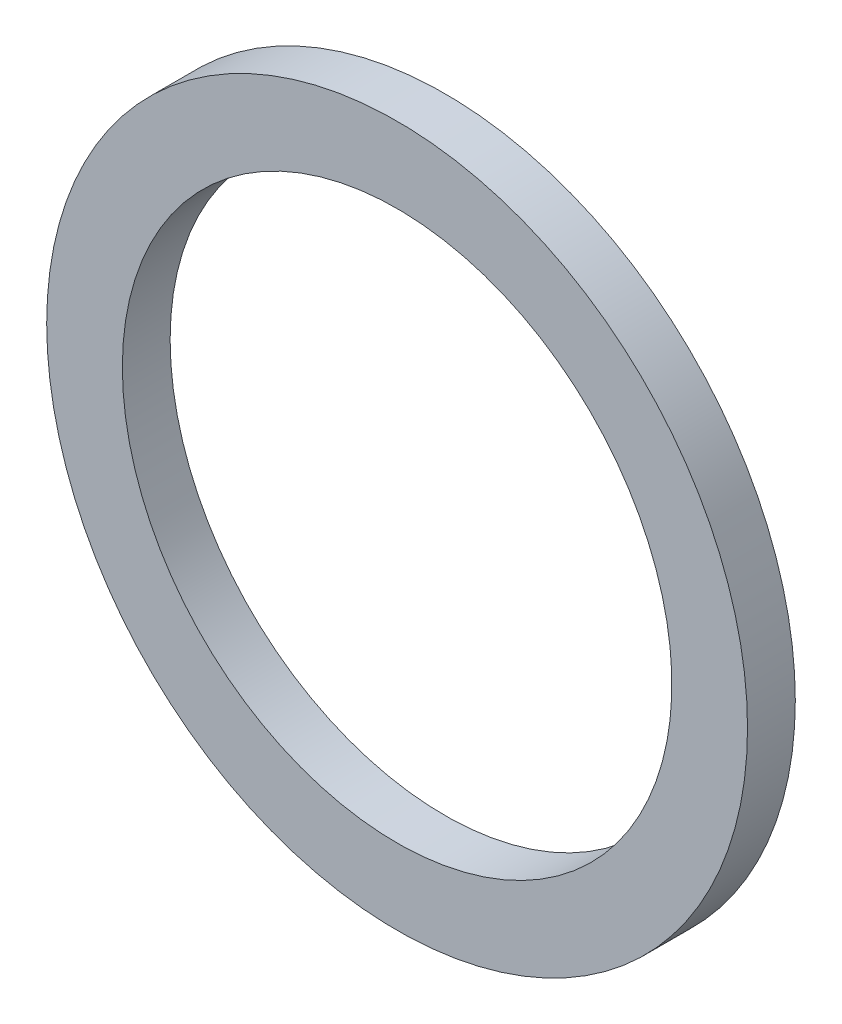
ISO-10303-21;
HEADER;
FILE_DESCRIPTION(('STEP AP214'),'2;1');
FILE_NAME('part.step','',(''),(''),'','','');
FILE_SCHEMA(('AUTOMOTIVE_DESIGN { 1 0 10303 214 1 1 1 1 }'));
ENDSEC;
DATA;
#1=APPLICATION_CONTEXT('core data for automotive mechanical design processes');
#2=APPLICATION_PROTOCOL_DEFINITION('international standard','automotive_design',2000,#1);
#3=PRODUCT_CONTEXT('',#1,'mechanical');
#4=PRODUCT('Part','Part','',(#3));
#5=PRODUCT_RELATED_PRODUCT_CATEGORY('part','',(#4));
#6=PRODUCT_DEFINITION_FORMATION('','',#4);
#7=PRODUCT_DEFINITION_CONTEXT('part definition',#1,'design');
#8=PRODUCT_DEFINITION('design','',#6,#7);
#9=PRODUCT_DEFINITION_SHAPE('','',#8);
#10=(LENGTH_UNIT() NAMED_UNIT(*) SI_UNIT(.MILLI.,.METRE.));
#11=(NAMED_UNIT(*) PLANE_ANGLE_UNIT() SI_UNIT($,.RADIAN.));
#12=(NAMED_UNIT(*) SI_UNIT($,.STERADIAN.) SOLID_ANGLE_UNIT());
#13=UNCERTAINTY_MEASURE_WITH_UNIT(LENGTH_MEASURE(1.E-05),#10,'distance_accuracy_value','');
#14=(GEOMETRIC_REPRESENTATION_CONTEXT(3) GLOBAL_UNCERTAINTY_ASSIGNED_CONTEXT((#13)) GLOBAL_UNIT_ASSIGNED_CONTEXT((#10,
#11,#12)) REPRESENTATION_CONTEXT('',''));
#15=CARTESIAN_POINT('',(0.,0.,0.));
#16=DIRECTION('',(0.,0.,1.));
#17=DIRECTION('',(1.,0.,0.));
#18=AXIS2_PLACEMENT_3D('',#15,#16,#17);
#19=CARTESIAN_POINT('',(0.,0.,1.5));
#20=DIRECTION('',(0.,0.,0.999999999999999));
#21=DIRECTION('',(0.999999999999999,0.,0.));
#22=AXIS2_PLACEMENT_3D('',#19,#20,#21);
#23=PLANE('',#22);
#24=CARTESIAN_POINT('',(0.,0.,1.5));
#25=DIRECTION('',(0.,0.,0.999999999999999));
#26=DIRECTION('',(0.999999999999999,0.,0.));
#27=AXIS2_PLACEMENT_3D('',#24,#25,#26);
#28=CIRCLE('',#27,11.);
#29=CARTESIAN_POINT('',(-11.,0.,1.5));
#30=VERTEX_POINT('',#29);
#31=EDGE_CURVE('E10',#30,#30,#28,.T.);
#32=ORIENTED_EDGE('',*,*,#31,.T.);
#33=EDGE_LOOP('',(#32));
#34=FACE_BOUND('',#33,.T.);
#35=CARTESIAN_POINT('',(0.,0.,1.5));
#36=DIRECTION('',(0.,0.,0.999999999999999));
#37=DIRECTION('',(0.999999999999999,0.,0.));
#38=AXIS2_PLACEMENT_3D('',#35,#36,#37);
#39=CIRCLE('',#38,8.625);
#40=CARTESIAN_POINT('',(-8.62499999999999,0.,1.5));
#41=VERTEX_POINT('',#40);
#42=EDGE_CURVE('E43',#41,#41,#39,.T.);
#43=ORIENTED_EDGE('',*,*,#42,.F.);
#44=EDGE_LOOP('',(#43));
#45=FACE_BOUND('',#44,.T.);
#46=ADVANCED_FACE('F32',(#34,#45),#23,.T.);
#47=CARTESIAN_POINT('',(0.,0.,0.));
#48=DIRECTION('',(0.,0.,0.999999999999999));
#49=DIRECTION('',(0.999999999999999,0.,0.));
#50=AXIS2_PLACEMENT_3D('',#47,#48,#49);
#51=PLANE('',#50);
#52=CARTESIAN_POINT('',(0.,0.,0.));
#53=DIRECTION('',(0.,0.,0.999999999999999));
#54=DIRECTION('',(0.999999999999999,0.,0.));
#55=AXIS2_PLACEMENT_3D('',#52,#53,#54);
#56=CIRCLE('',#55,11.);
#57=CARTESIAN_POINT('',(-11.,0.,0.));
#58=VERTEX_POINT('',#57);
#59=EDGE_CURVE('E39',#58,#58,#56,.T.);
#60=ORIENTED_EDGE('',*,*,#59,.F.);
#61=EDGE_LOOP('',(#60));
#62=FACE_BOUND('',#61,.T.);
#63=CARTESIAN_POINT('',(0.,0.,0.));
#64=DIRECTION('',(0.,0.,0.999999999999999));
#65=DIRECTION('',(0.999999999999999,0.,0.));
#66=AXIS2_PLACEMENT_3D('',#63,#64,#65);
#67=CIRCLE('',#66,8.625);
#68=CARTESIAN_POINT('',(-8.62499999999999,0.,0.));
#69=VERTEX_POINT('',#68);
#70=EDGE_CURVE('E47',#69,#69,#67,.T.);
#71=ORIENTED_EDGE('',*,*,#70,.T.);
#72=EDGE_LOOP('',(#71));
#73=FACE_BOUND('',#72,.T.);
#74=ADVANCED_FACE('F53',(#62,#73),#51,.F.);
#75=CARTESIAN_POINT('',(0.,0.,1.5));
#76=DIRECTION('',(0.,0.,-0.999999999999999));
#77=DIRECTION('',(-0.999999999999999,0.,0.));
#78=AXIS2_PLACEMENT_3D('',#75,#76,#77);
#79=CYLINDRICAL_SURFACE('',#78,11.);
#80=CARTESIAN_POINT('',(-11.,0.,1.5));
#81=CARTESIAN_POINT('',(-11.,0.,1.484375));
#82=CARTESIAN_POINT('',(-11.,0.,1.46875));
#83=CARTESIAN_POINT('',(-11.,0.,1.4375));
#84=CARTESIAN_POINT('',(-11.,0.,1.421875));
#85=CARTESIAN_POINT('',(-11.,0.,1.390625));
#86=CARTESIAN_POINT('',(-11.,0.,1.375));
#87=CARTESIAN_POINT('',(-11.,0.,1.34375));
#88=CARTESIAN_POINT('',(-11.,0.,1.328125));
#89=CARTESIAN_POINT('',(-11.,0.,1.296875));
#90=CARTESIAN_POINT('',(-11.,0.,1.28125));
#91=CARTESIAN_POINT('',(-11.,0.,1.25));
#92=CARTESIAN_POINT('',(-11.,0.,1.234375));
#93=CARTESIAN_POINT('',(-11.,0.,1.203125));
#94=CARTESIAN_POINT('',(-11.,0.,1.1875));
#95=CARTESIAN_POINT('',(-11.,0.,1.15625));
#96=CARTESIAN_POINT('',(-11.,0.,1.140625));
#97=CARTESIAN_POINT('',(-11.,0.,1.109375));
#98=CARTESIAN_POINT('',(-11.,0.,1.09375));
#99=CARTESIAN_POINT('',(-11.,0.,1.0625));
#100=CARTESIAN_POINT('',(-11.,0.,1.046875));
#101=CARTESIAN_POINT('',(-11.,0.,1.015625));
#102=CARTESIAN_POINT('',(-11.,0.,1.));
#103=CARTESIAN_POINT('',(-11.,0.,0.968750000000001));
#104=CARTESIAN_POINT('',(-11.,0.,0.953125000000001));
#105=CARTESIAN_POINT('',(-11.,0.,0.921875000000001));
#106=CARTESIAN_POINT('',(-11.,0.,0.906250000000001));
#107=CARTESIAN_POINT('',(-11.,0.,0.875000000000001));
#108=CARTESIAN_POINT('',(-11.,0.,0.859375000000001));
#109=CARTESIAN_POINT('',(-11.,0.,0.828125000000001));
#110=CARTESIAN_POINT('',(-11.,0.,0.812500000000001));
#111=CARTESIAN_POINT('',(-11.,0.,0.781250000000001));
#112=CARTESIAN_POINT('',(-11.,0.,0.765625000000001));
#113=CARTESIAN_POINT('',(-11.,0.,0.734375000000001));
#114=CARTESIAN_POINT('',(-11.,0.,0.718750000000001));
#115=CARTESIAN_POINT('',(-11.,0.,0.687500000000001));
#116=CARTESIAN_POINT('',(-11.,0.,0.671875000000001));
#117=CARTESIAN_POINT('',(-11.,0.,0.640625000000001));
#118=CARTESIAN_POINT('',(-11.,0.,0.625000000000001));
#119=CARTESIAN_POINT('',(-11.,0.,0.593750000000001));
#120=CARTESIAN_POINT('',(-11.,0.,0.578125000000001));
#121=CARTESIAN_POINT('',(-11.,0.,0.546875));
#122=CARTESIAN_POINT('',(-11.,0.,0.53125));
#123=CARTESIAN_POINT('',(-11.,0.,0.5));
#124=CARTESIAN_POINT('',(-11.,0.,0.484375));
#125=CARTESIAN_POINT('',(-11.,0.,0.453125));
#126=CARTESIAN_POINT('',(-11.,0.,0.4375));
#127=CARTESIAN_POINT('',(-11.,0.,0.40625));
#128=CARTESIAN_POINT('',(-11.,0.,0.390625));
#129=CARTESIAN_POINT('',(-11.,0.,0.359375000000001));
#130=CARTESIAN_POINT('',(-11.,0.,0.34375));
#131=CARTESIAN_POINT('',(-11.,0.,0.3125));
#132=CARTESIAN_POINT('',(-11.,0.,0.296875));
#133=CARTESIAN_POINT('',(-11.,0.,0.265625));
#134=CARTESIAN_POINT('',(-11.,0.,0.25));
#135=CARTESIAN_POINT('',(-11.,0.,0.21875));
#136=CARTESIAN_POINT('',(-11.,0.,0.203125));
#137=CARTESIAN_POINT('',(-11.,0.,0.171875));
#138=CARTESIAN_POINT('',(-11.,0.,0.15625));
#139=CARTESIAN_POINT('',(-11.,0.,0.125));
#140=CARTESIAN_POINT('',(-11.,0.,0.109375));
#141=CARTESIAN_POINT('',(-11.,0.,0.0781250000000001));
#142=CARTESIAN_POINT('',(-11.,0.,0.0625000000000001));
#143=CARTESIAN_POINT('',(-11.,0.,0.03125));
#144=CARTESIAN_POINT('',(-11.,0.,0.015625));
#145=CARTESIAN_POINT('',(-11.,0.,0.));
#146=B_SPLINE_CURVE_WITH_KNOTS('',3,(#80,#81,#82,#83,#84,#85,#86,#87,#88,#89,#90,#91,#92,#93,
#94,#95,#96,#97,#98,#99,#100,#101,#102,#103,#104,#105,#106,#107,#108,#109,#110,#111,#112,#113,
#114,#115,#116,#117,#118,#119,#120,#121,#122,#123,#124,#125,#126,#127,#128,#129,#130,#131,#132,
#133,#134,#135,#136,#137,#138,#139,#140,#141,#142,#143,#144,#145),.UNSPECIFIED.,.F.,.F.,(4,2,2,
2,2,2,2,2,2,2,2,2,2,2,2,2,2,2,2,2,2,2,2,2,2,2,2,2,2,2,2,2,4),(0.,0.0468750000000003,
0.0937500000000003,0.140625,0.1875,0.234375,0.28125,0.328125,0.375000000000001,
0.421875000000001,0.468750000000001,0.515625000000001,0.562500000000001,0.609375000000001,
0.656250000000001,0.703125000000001,0.750000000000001,0.796875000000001,0.843750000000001,
0.890625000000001,0.937500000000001,0.984375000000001,1.03125,1.078125,1.125,1.171875,1.21875,
1.265625,1.3125,1.359375,1.40625,1.453125,1.5),.UNSPECIFIED.);
#147=EDGE_CURVE('BSEAM34',#30,#58,#146,.T.);
#148=ORIENTED_EDGE('',*,*,#31,.F.);
#149=ORIENTED_EDGE('',*,*,#59,.T.);
#150=ORIENTED_EDGE('',*,*,#147,.T.);
#151=ORIENTED_EDGE('',*,*,#147,.F.);
#152=EDGE_LOOP('',(#148,#150,#149,#151));
#153=FACE_BOUND('',#152,.T.);
#154=ADVANCED_FACE('F34',(#153),#79,.T.);
#155=CARTESIAN_POINT('',(0.,0.,1.5));
#156=DIRECTION('',(0.,0.,-0.999999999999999));
#157=DIRECTION('',(-0.999999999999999,0.,0.));
#158=AXIS2_PLACEMENT_3D('',#155,#156,#157);
#159=CYLINDRICAL_SURFACE('',#158,8.625);
#160=CARTESIAN_POINT('',(-8.62499999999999,0.,1.5));
#161=CARTESIAN_POINT('',(-8.62499999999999,0.,1.484375));
#162=CARTESIAN_POINT('',(-8.62499999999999,0.,1.46875));
#163=CARTESIAN_POINT('',(-8.62499999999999,0.,1.4375));
#164=CARTESIAN_POINT('',(-8.62499999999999,0.,1.421875));
#165=CARTESIAN_POINT('',(-8.62499999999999,0.,1.390625));
#166=CARTESIAN_POINT('',(-8.62499999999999,0.,1.375));
#167=CARTESIAN_POINT('',(-8.62499999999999,0.,1.34375));
#168=CARTESIAN_POINT('',(-8.62499999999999,0.,1.328125));
#169=CARTESIAN_POINT('',(-8.62499999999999,0.,1.296875));
#170=CARTESIAN_POINT('',(-8.62499999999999,0.,1.28125));
#171=CARTESIAN_POINT('',(-8.62499999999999,0.,1.25));
#172=CARTESIAN_POINT('',(-8.62499999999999,0.,1.234375));
#173=CARTESIAN_POINT('',(-8.62499999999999,0.,1.203125));
#174=CARTESIAN_POINT('',(-8.62499999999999,0.,1.1875));
#175=CARTESIAN_POINT('',(-8.62499999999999,0.,1.15625));
#176=CARTESIAN_POINT('',(-8.62499999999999,0.,1.140625));
#177=CARTESIAN_POINT('',(-8.62499999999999,0.,1.109375));
#178=CARTESIAN_POINT('',(-8.62499999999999,0.,1.09375));
#179=CARTESIAN_POINT('',(-8.62499999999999,0.,1.0625));
#180=CARTESIAN_POINT('',(-8.62499999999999,0.,1.046875));
#181=CARTESIAN_POINT('',(-8.62499999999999,0.,1.015625));
#182=CARTESIAN_POINT('',(-8.62499999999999,0.,1.));
#183=CARTESIAN_POINT('',(-8.62499999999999,0.,0.968750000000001));
#184=CARTESIAN_POINT('',(-8.62499999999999,0.,0.953125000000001));
#185=CARTESIAN_POINT('',(-8.62499999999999,0.,0.921875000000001));
#186=CARTESIAN_POINT('',(-8.62499999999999,0.,0.906250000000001));
#187=CARTESIAN_POINT('',(-8.62499999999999,0.,0.875000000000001));
#188=CARTESIAN_POINT('',(-8.62499999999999,0.,0.859375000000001));
#189=CARTESIAN_POINT('',(-8.62499999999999,0.,0.828125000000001));
#190=CARTESIAN_POINT('',(-8.62499999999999,0.,0.812500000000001));
#191=CARTESIAN_POINT('',(-8.62499999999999,0.,0.781250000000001));
#192=CARTESIAN_POINT('',(-8.62499999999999,0.,0.765625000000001));
#193=CARTESIAN_POINT('',(-8.62499999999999,0.,0.734375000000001));
#194=CARTESIAN_POINT('',(-8.62499999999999,0.,0.718750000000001));
#195=CARTESIAN_POINT('',(-8.62499999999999,0.,0.687500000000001));
#196=CARTESIAN_POINT('',(-8.62499999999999,0.,0.671875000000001));
#197=CARTESIAN_POINT('',(-8.62499999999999,0.,0.640625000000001));
#198=CARTESIAN_POINT('',(-8.62499999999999,0.,0.625000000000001));
#199=CARTESIAN_POINT('',(-8.62499999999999,0.,0.593750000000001));
#200=CARTESIAN_POINT('',(-8.62499999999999,0.,0.578125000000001));
#201=CARTESIAN_POINT('',(-8.62499999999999,0.,0.546875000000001));
#202=CARTESIAN_POINT('',(-8.62499999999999,0.,0.53125));
#203=CARTESIAN_POINT('',(-8.62499999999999,0.,0.5));
#204=CARTESIAN_POINT('',(-8.62499999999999,0.,0.484375));
#205=CARTESIAN_POINT('',(-8.62499999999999,0.,0.453125));
#206=CARTESIAN_POINT('',(-8.62499999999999,0.,0.4375));
#207=CARTESIAN_POINT('',(-8.62499999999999,0.,0.40625));
#208=CARTESIAN_POINT('',(-8.62499999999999,0.,0.390625));
#209=CARTESIAN_POINT('',(-8.62499999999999,0.,0.359375));
#210=CARTESIAN_POINT('',(-8.62499999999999,0.,0.34375));
#211=CARTESIAN_POINT('',(-8.62499999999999,0.,0.3125));
#212=CARTESIAN_POINT('',(-8.62499999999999,0.,0.296875));
#213=CARTESIAN_POINT('',(-8.62499999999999,0.,0.265625));
#214=CARTESIAN_POINT('',(-8.62499999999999,0.,0.25));
#215=CARTESIAN_POINT('',(-8.62499999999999,0.,0.21875));
#216=CARTESIAN_POINT('',(-8.62499999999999,0.,0.203125));
#217=CARTESIAN_POINT('',(-8.62499999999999,0.,0.171875));
#218=CARTESIAN_POINT('',(-8.62499999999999,0.,0.15625));
#219=CARTESIAN_POINT('',(-8.62499999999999,0.,0.125));
#220=CARTESIAN_POINT('',(-8.62499999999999,0.,0.109375));
#221=CARTESIAN_POINT('',(-8.62499999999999,0.,0.0781250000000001));
#222=CARTESIAN_POINT('',(-8.62499999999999,0.,0.0625000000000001));
#223=CARTESIAN_POINT('',(-8.62499999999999,0.,0.03125));
#224=CARTESIAN_POINT('',(-8.62499999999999,0.,0.015625));
#225=CARTESIAN_POINT('',(-8.62499999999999,0.,0.));
#226=B_SPLINE_CURVE_WITH_KNOTS('',3,(#160,#161,#162,#163,#164,#165,#166,#167,#168,#169,#170,
#171,#172,#173,#174,#175,#176,#177,#178,#179,#180,#181,#182,#183,#184,#185,#186,#187,#188,#189,
#190,#191,#192,#193,#194,#195,#196,#197,#198,#199,#200,#201,#202,#203,#204,#205,#206,#207,#208,
#209,#210,#211,#212,#213,#214,#215,#216,#217,#218,#219,#220,#221,#222,#223,#224,#225),
.UNSPECIFIED.,.F.,.F.,(4,2,2,2,2,2,2,2,2,2,2,2,2,2,2,2,2,2,2,2,2,2,2,2,2,2,2,2,2,2,2,2,4),(0.,
0.046875,0.0937500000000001,0.140625,0.1875,0.234375,0.28125,0.328125,0.375,0.421875,0.46875,
0.515625,0.5625,0.609375,0.65625,0.703125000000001,0.750000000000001,0.796875,0.843750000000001,
0.890625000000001,0.937500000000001,0.984375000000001,1.03125,1.078125,1.125,1.171875,1.21875,
1.265625,1.3125,1.359375,1.40625,1.453125,1.5),.UNSPECIFIED.);
#227=EDGE_CURVE('BSEAM55',#41,#69,#226,.T.);
#228=ORIENTED_EDGE('',*,*,#42,.T.);
#229=ORIENTED_EDGE('',*,*,#70,.F.);
#230=ORIENTED_EDGE('',*,*,#227,.T.);
#231=ORIENTED_EDGE('',*,*,#227,.F.);
#232=EDGE_LOOP('',(#228,#230,#229,#231));
#233=FACE_BOUND('',#232,.T.);
#234=ADVANCED_FACE('F55',(#233),#159,.F.);
#235=CLOSED_SHELL('',(#46,#74,#154,#234));
#236=MANIFOLD_SOLID_BREP('B2',#235);
#237=ADVANCED_BREP_SHAPE_REPRESENTATION('',(#18,#236),#14);
#238=SHAPE_DEFINITION_REPRESENTATION(#9,#237);
ENDSEC;
END-ISO-10303-21;
